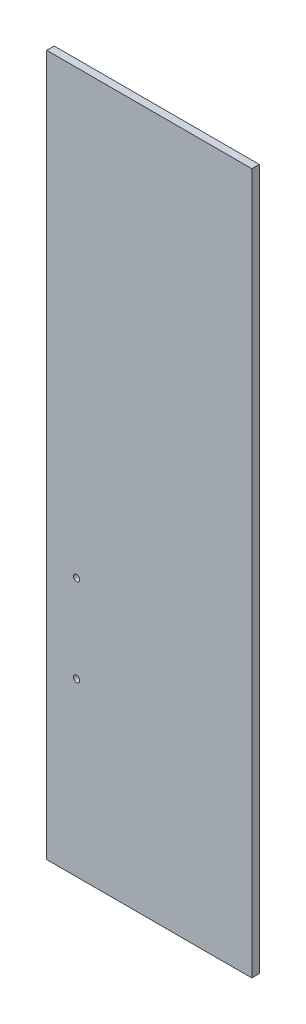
ISO-10303-21;
HEADER;
FILE_DESCRIPTION(('STEP AP214'),'2;1');
FILE_NAME('part.step','',(''),(''),'','','');
FILE_SCHEMA(('AUTOMOTIVE_DESIGN { 1 0 10303 214 1 1 1 1 }'));
ENDSEC;
DATA;
#1=APPLICATION_CONTEXT('core data for automotive mechanical design processes');
#2=APPLICATION_PROTOCOL_DEFINITION('international standard','automotive_design',2000,#1);
#3=PRODUCT_CONTEXT('',#1,'mechanical');
#4=PRODUCT('Part','Part','',(#3));
#5=PRODUCT_RELATED_PRODUCT_CATEGORY('part','',(#4));
#6=PRODUCT_DEFINITION_FORMATION('','',#4);
#7=PRODUCT_DEFINITION_CONTEXT('part definition',#1,'design');
#8=PRODUCT_DEFINITION('design','',#6,#7);
#9=PRODUCT_DEFINITION_SHAPE('','',#8);
#10=(LENGTH_UNIT() NAMED_UNIT(*) SI_UNIT(.MILLI.,.METRE.));
#11=(NAMED_UNIT(*) PLANE_ANGLE_UNIT() SI_UNIT($,.RADIAN.));
#12=(NAMED_UNIT(*) SI_UNIT($,.STERADIAN.) SOLID_ANGLE_UNIT());
#13=UNCERTAINTY_MEASURE_WITH_UNIT(LENGTH_MEASURE(1.E-05),#10,'distance_accuracy_value','');
#14=(GEOMETRIC_REPRESENTATION_CONTEXT(3) GLOBAL_UNCERTAINTY_ASSIGNED_CONTEXT((#13)) GLOBAL_UNIT_ASSIGNED_CONTEXT((#10,
#11,#12)) REPRESENTATION_CONTEXT('',''));
#15=CARTESIAN_POINT('',(0.,0.,0.));
#16=DIRECTION('',(0.,0.,1.));
#17=DIRECTION('',(1.,0.,0.));
#18=AXIS2_PLACEMENT_3D('',#15,#16,#17);
#19=CARTESIAN_POINT('',(0.,940.,10.));
#20=DIRECTION('',(1.,0.,0.));
#21=DIRECTION('',(0.,1.,0.));
#22=AXIS2_PLACEMENT_3D('',#19,#20,#21);
#23=PLANE('',#22);
#24=DIRECTION('',(0.,-1.,0.));
#25=VECTOR('',#24,1.);
#26=CARTESIAN_POINT('',(0.,940.,0.));
#27=LINE('',#26,#25);
#28=CARTESIAN_POINT('',(0.,940.,0.));
#29=VERTEX_POINT('',#28);
#30=CARTESIAN_POINT('',(0.,0.,0.));
#31=VERTEX_POINT('',#30);
#32=EDGE_CURVE('E77',#29,#31,#27,.T.);
#33=ORIENTED_EDGE('',*,*,#32,.T.);
#34=DIRECTION('',(0.,0.,-1.));
#35=VECTOR('',#34,1.);
#36=CARTESIAN_POINT('',(0.,0.,10.));
#37=LINE('',#36,#35);
#38=CARTESIAN_POINT('',(0.,0.,10.));
#39=VERTEX_POINT('',#38);
#40=EDGE_CURVE('E11',#39,#31,#37,.T.);
#41=ORIENTED_EDGE('',*,*,#40,.F.);
#42=DIRECTION('',(0.,-1.,0.));
#43=VECTOR('',#42,1.);
#44=CARTESIAN_POINT('',(0.,940.,10.));
#45=LINE('',#44,#43);
#46=CARTESIAN_POINT('',(0.,940.,10.));
#47=VERTEX_POINT('',#46);
#48=EDGE_CURVE('E100',#47,#39,#45,.T.);
#49=ORIENTED_EDGE('',*,*,#48,.F.);
#50=DIRECTION('',(0.,0.,-1.));
#51=VECTOR('',#50,1.);
#52=CARTESIAN_POINT('',(0.,940.,10.));
#53=LINE('',#52,#51);
#54=EDGE_CURVE('E89',#47,#29,#53,.T.);
#55=ORIENTED_EDGE('',*,*,#54,.T.);
#56=EDGE_LOOP('',(#33,#41,#49,#55));
#57=FACE_BOUND('',#56,.T.);
#58=ADVANCED_FACE('F33',(#57),#23,.F.);
#59=CARTESIAN_POINT('',(0.,0.,10.));
#60=DIRECTION('',(0.,1.,0.));
#61=DIRECTION('',(0.,0.,1.));
#62=AXIS2_PLACEMENT_3D('',#59,#60,#61);
#63=PLANE('',#62);
#64=DIRECTION('',(1.,0.,0.));
#65=VECTOR('',#64,1.);
#66=CARTESIAN_POINT('',(0.,0.,0.));
#67=LINE('',#66,#65);
#68=CARTESIAN_POINT('',(275.,0.,0.));
#69=VERTEX_POINT('',#68);
#70=EDGE_CURVE('E73',#31,#69,#67,.T.);
#71=ORIENTED_EDGE('',*,*,#70,.T.);
#72=DIRECTION('',(0.,0.,-1.));
#73=VECTOR('',#72,1.);
#74=CARTESIAN_POINT('',(275.,0.,10.));
#75=LINE('',#74,#73);
#76=CARTESIAN_POINT('',(275.,0.,10.));
#77=VERTEX_POINT('',#76);
#78=EDGE_CURVE('E40',#77,#69,#75,.T.);
#79=ORIENTED_EDGE('',*,*,#78,.F.);
#80=DIRECTION('',(1.,0.,0.));
#81=VECTOR('',#80,1.);
#82=CARTESIAN_POINT('',(0.,0.,10.));
#83=LINE('',#82,#81);
#84=EDGE_CURVE('E85',#39,#77,#83,.T.);
#85=ORIENTED_EDGE('',*,*,#84,.F.);
#86=ORIENTED_EDGE('',*,*,#40,.T.);
#87=EDGE_LOOP('',(#71,#79,#85,#86));
#88=FACE_BOUND('',#87,.T.);
#89=ADVANCED_FACE('F84',(#88),#63,.F.);
#90=CARTESIAN_POINT('',(275.,0.,10.));
#91=DIRECTION('',(-1.,0.,0.));
#92=DIRECTION('',(0.,0.,1.));
#93=AXIS2_PLACEMENT_3D('',#90,#91,#92);
#94=PLANE('',#93);
#95=DIRECTION('',(0.,1.,0.));
#96=VECTOR('',#95,1.);
#97=CARTESIAN_POINT('',(275.,0.,0.));
#98=LINE('',#97,#96);
#99=CARTESIAN_POINT('',(275.,940.,0.));
#100=VERTEX_POINT('',#99);
#101=EDGE_CURVE('E78',#69,#100,#98,.T.);
#102=ORIENTED_EDGE('',*,*,#101,.T.);
#103=DIRECTION('',(0.,0.,-1.));
#104=VECTOR('',#103,1.);
#105=CARTESIAN_POINT('',(275.,940.,10.));
#106=LINE('',#105,#104);
#107=CARTESIAN_POINT('',(275.,940.,10.));
#108=VERTEX_POINT('',#107);
#109=EDGE_CURVE('E106',#108,#100,#106,.T.);
#110=ORIENTED_EDGE('',*,*,#109,.F.);
#111=DIRECTION('',(0.,1.,0.));
#112=VECTOR('',#111,1.);
#113=CARTESIAN_POINT('',(275.,0.,10.));
#114=LINE('',#113,#112);
#115=EDGE_CURVE('E52',#77,#108,#114,.T.);
#116=ORIENTED_EDGE('',*,*,#115,.F.);
#117=ORIENTED_EDGE('',*,*,#78,.T.);
#118=EDGE_LOOP('',(#102,#110,#116,#117));
#119=FACE_BOUND('',#118,.T.);
#120=ADVANCED_FACE('F109',(#119),#94,.F.);
#121=CARTESIAN_POINT('',(275.,940.,10.));
#122=DIRECTION('',(0.,-1.,0.));
#123=DIRECTION('',(0.,0.,-1.));
#124=AXIS2_PLACEMENT_3D('',#121,#122,#123);
#125=PLANE('',#124);
#126=DIRECTION('',(-1.,0.,0.));
#127=VECTOR('',#126,1.);
#128=CARTESIAN_POINT('',(275.,940.,0.));
#129=LINE('',#128,#127);
#130=EDGE_CURVE('E98',#100,#29,#129,.T.);
#131=ORIENTED_EDGE('',*,*,#130,.T.);
#132=ORIENTED_EDGE('',*,*,#54,.F.);
#133=DIRECTION('',(-1.,0.,0.));
#134=VECTOR('',#133,1.);
#135=CARTESIAN_POINT('',(275.,940.,10.));
#136=LINE('',#135,#134);
#137=EDGE_CURVE('E47',#108,#47,#136,.T.);
#138=ORIENTED_EDGE('',*,*,#137,.F.);
#139=ORIENTED_EDGE('',*,*,#109,.T.);
#140=EDGE_LOOP('',(#131,#132,#138,#139));
#141=FACE_BOUND('',#140,.T.);
#142=ADVANCED_FACE('F111',(#141),#125,.F.);
#143=CARTESIAN_POINT('',(0.,0.,10.));
#144=DIRECTION('',(0.,0.,1.));
#145=DIRECTION('',(1.,0.,0.));
#146=AXIS2_PLACEMENT_3D('',#143,#144,#145);
#147=PLANE('',#146);
#148=CARTESIAN_POINT('',(40.,347.,10.));
#149=DIRECTION('',(0.,0.,1.));
#150=DIRECTION('',(1.,0.,0.));
#151=AXIS2_PLACEMENT_3D('',#148,#149,#150);
#152=CIRCLE('',#151,4.25);
#153=CARTESIAN_POINT('',(44.25,347.,10.));
#154=VERTEX_POINT('',#153);
#155=EDGE_CURVE('E178',#154,#154,#152,.T.);
#156=ORIENTED_EDGE('',*,*,#155,.F.);
#157=EDGE_LOOP('',(#156));
#158=FACE_BOUND('',#157,.T.);
#159=CARTESIAN_POINT('',(40.,230.,10.));
#160=DIRECTION('',(0.,0.,1.));
#161=DIRECTION('',(1.,0.,0.));
#162=AXIS2_PLACEMENT_3D('',#159,#160,#161);
#163=CIRCLE('',#162,4.25);
#164=CARTESIAN_POINT('',(44.25,230.,10.));
#165=VERTEX_POINT('',#164);
#166=EDGE_CURVE('E90',#165,#165,#163,.T.);
#167=ORIENTED_EDGE('',*,*,#166,.F.);
#168=EDGE_LOOP('',(#167));
#169=FACE_BOUND('',#168,.T.);
#170=ORIENTED_EDGE('',*,*,#48,.T.);
#171=ORIENTED_EDGE('',*,*,#84,.T.);
#172=ORIENTED_EDGE('',*,*,#115,.T.);
#173=ORIENTED_EDGE('',*,*,#137,.T.);
#174=EDGE_LOOP('',(#170,#171,#172,#173));
#175=FACE_BOUND('',#174,.T.);
#176=ADVANCED_FACE('F112',(#158,#169,#175),#147,.T.);
#177=CARTESIAN_POINT('',(0.,0.,0.));
#178=DIRECTION('',(0.,0.,1.));
#179=DIRECTION('',(1.,0.,0.));
#180=AXIS2_PLACEMENT_3D('',#177,#178,#179);
#181=PLANE('',#180);
#182=CARTESIAN_POINT('',(40.,347.,0.));
#183=DIRECTION('',(0.,0.,1.));
#184=DIRECTION('',(1.,0.,0.));
#185=AXIS2_PLACEMENT_3D('',#182,#183,#184);
#186=CIRCLE('',#185,4.25);
#187=CARTESIAN_POINT('',(44.25,347.,0.));
#188=VERTEX_POINT('',#187);
#189=EDGE_CURVE('E176',#188,#188,#186,.T.);
#190=ORIENTED_EDGE('',*,*,#189,.T.);
#191=EDGE_LOOP('',(#190));
#192=FACE_BOUND('',#191,.T.);
#193=CARTESIAN_POINT('',(40.,230.,0.));
#194=DIRECTION('',(0.,0.,1.));
#195=DIRECTION('',(1.,0.,0.));
#196=AXIS2_PLACEMENT_3D('',#193,#194,#195);
#197=CIRCLE('',#196,4.25);
#198=CARTESIAN_POINT('',(44.25,230.,0.));
#199=VERTEX_POINT('',#198);
#200=EDGE_CURVE('E93',#199,#199,#197,.T.);
#201=ORIENTED_EDGE('',*,*,#200,.T.);
#202=EDGE_LOOP('',(#201));
#203=FACE_BOUND('',#202,.T.);
#204=ORIENTED_EDGE('',*,*,#32,.F.);
#205=ORIENTED_EDGE('',*,*,#130,.F.);
#206=ORIENTED_EDGE('',*,*,#101,.F.);
#207=ORIENTED_EDGE('',*,*,#70,.F.);
#208=EDGE_LOOP('',(#204,#205,#206,#207));
#209=FACE_BOUND('',#208,.T.);
#210=ADVANCED_FACE('F74',(#192,#203,#209),#181,.F.);
#211=CARTESIAN_POINT('',(40.,230.,10.));
#212=DIRECTION('',(0.,0.,1.));
#213=DIRECTION('',(1.,0.,0.));
#214=AXIS2_PLACEMENT_3D('',#211,#212,#213);
#215=CYLINDRICAL_SURFACE('',#214,4.25);
#216=ORIENTED_EDGE('',*,*,#200,.F.);
#217=EDGE_LOOP('',(#216));
#218=FACE_BOUND('',#217,.T.);
#219=ORIENTED_EDGE('',*,*,#166,.T.);
#220=EDGE_LOOP('',(#219));
#221=FACE_BOUND('',#220,.T.);
#222=ADVANCED_FACE('F120',(#218,#221),#215,.F.);
#223=CARTESIAN_POINT('',(40.,347.,10.));
#224=DIRECTION('',(0.,0.,1.));
#225=DIRECTION('',(1.,0.,0.));
#226=AXIS2_PLACEMENT_3D('',#223,#224,#225);
#227=CYLINDRICAL_SURFACE('',#226,4.25);
#228=ORIENTED_EDGE('',*,*,#189,.F.);
#229=EDGE_LOOP('',(#228));
#230=FACE_BOUND('',#229,.T.);
#231=ORIENTED_EDGE('',*,*,#155,.T.);
#232=EDGE_LOOP('',(#231));
#233=FACE_BOUND('',#232,.T.);
#234=ADVANCED_FACE('F159',(#230,#233),#227,.F.);
#235=CLOSED_SHELL('',(#58,#89,#120,#142,#176,#210,#222,#234));
#236=MANIFOLD_SOLID_BREP('B2',#235);
#237=ADVANCED_BREP_SHAPE_REPRESENTATION('',(#18,#236),#14);
#238=SHAPE_DEFINITION_REPRESENTATION(#9,#237);
ENDSEC;
END-ISO-10303-21;
